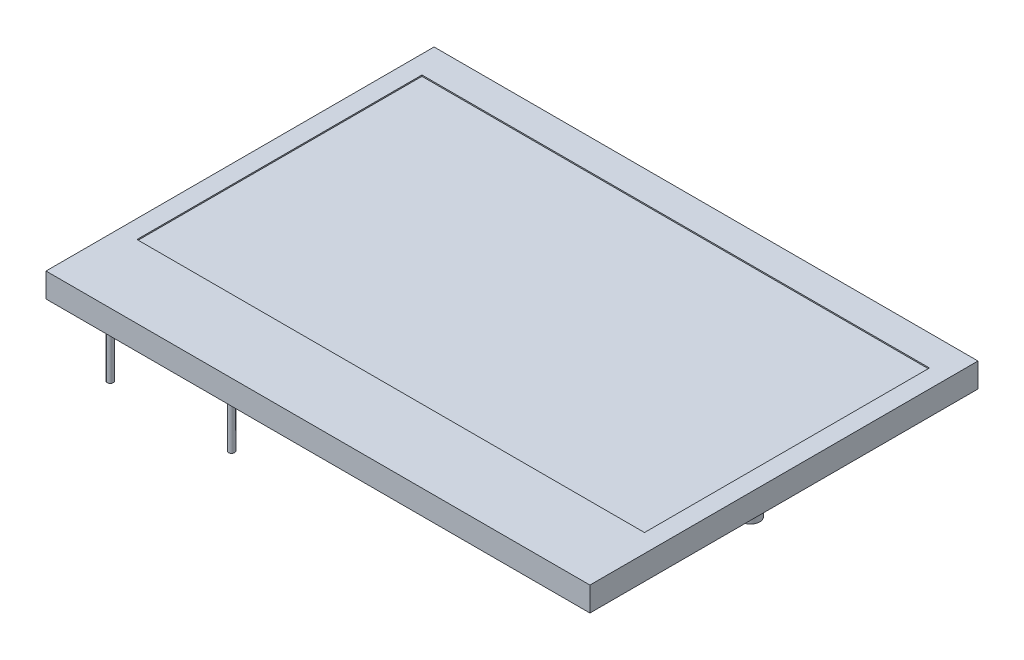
from build123d import *

# Parameters (mm, degrees)
EXTRUDE_START       = 2.5
SKETCH_1_W          = 44.85
SKETCH_1_H          = 32
EXTRUDE_1_DEPTH     = 2
SKETCH_2_W          = 41.85
SKETCH_2_H          = 23.5
CUT_EXTRUDE_2_DEPTH = 0.1
SKETCH_3_R          = 1.5
EXTRUDE_3_DEPTH     = 2.5
SKETCH_4_R          = 0.75
EXTRUDE_4_DEPTH     = 1.5
SKETCH_5_R          = 0.25
EXTRUDE_5_DEPTH     = 4.5


with BuildPart() as part:
    # Sketch 1 → Extrude 1 (new body)
    with BuildSketch(Plane(origin=(0, 0, 0), x_dir=(1, 0, 0), z_dir=(0, 1, 0)).offset(EXTRUDE_START)):
        with Locations((0, -1.5)):
            Rectangle(SKETCH_1_W, SKETCH_1_H)
    extrude(amount=EXTRUDE_1_DEPTH)

    # Sketch 2 → Cut-Extrude 2 (cut)
    with BuildSketch(Plane(origin=(0, 4.5, 0), x_dir=(1, 0, 0), z_dir=(0, 1, 0))):
        with Locations((0, 0.25)):
            Rectangle(SKETCH_2_W, SKETCH_2_H)
    extrude(amount=-CUT_EXTRUDE_2_DEPTH, mode=Mode.SUBTRACT)

    # Sketch 3 → Extrude 3 (add)
    with BuildSketch(Plane.XZ.offset(-2.5)):
        with Locations(Location((-18.17, 0, 0), (0, 0, 270))):
            Circle(SKETCH_3_R)
        with Locations(Location((18.17, 0, 0), (0, 0, 90))):
            Circle(SKETCH_3_R)
    extrude(amount=EXTRUDE_3_DEPTH)

    # Sketch 4 → Extrude 4 (add)
    with BuildSketch(Plane.XZ):
        with Locations(Location((-18.17, 0, 0), (0, 0, 270))):
            Circle(SKETCH_4_R)
        with Locations(Location((18.17, 0, 0), (0, 0, 90))):
            Circle(SKETCH_4_R)
    extrude(amount=EXTRUDE_4_DEPTH)

    # Sketch 5 → Extrude 5 (add)
    with BuildSketch(Plane.XZ.offset(-2.5)):
        with Locations(Location((-18.425, 16.2, 0), (0, 0, 270))):
            Circle(SKETCH_5_R)
        with Locations(Location((-8.425, 16.2, 0), (0, 0, 270))):
            Circle(SKETCH_5_R)
    extrude(amount=EXTRUDE_5_DEPTH)


solid = part.part
